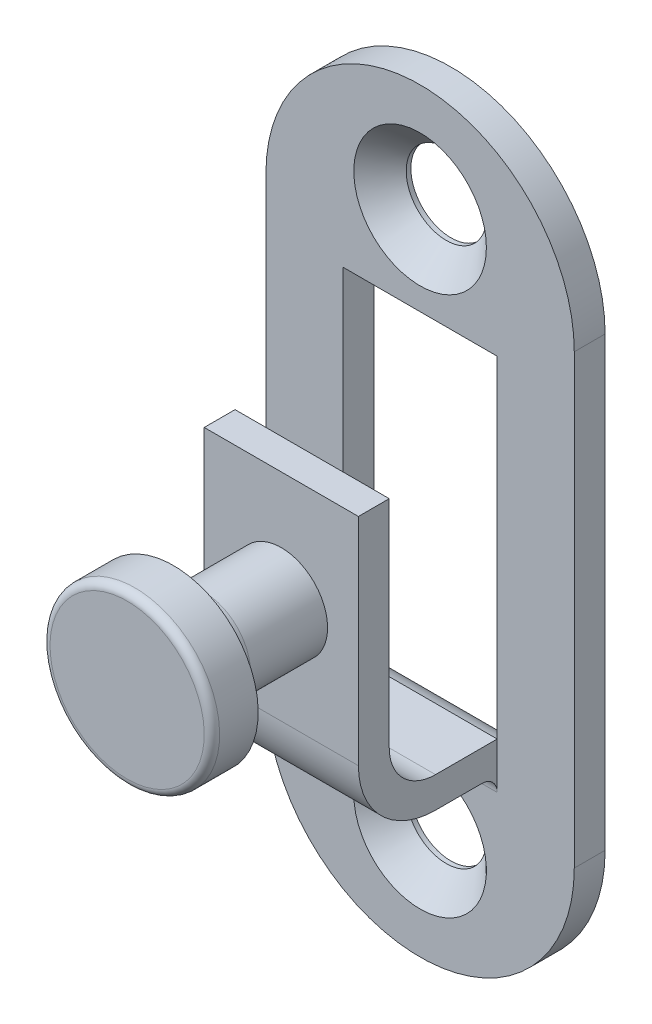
ISO-10303-21;
HEADER;
FILE_DESCRIPTION(('STEP AP214'),'2;1');
FILE_NAME('part.step','',(''),(''),'','','');
FILE_SCHEMA(('AUTOMOTIVE_DESIGN { 1 0 10303 214 1 1 1 1 }'));
ENDSEC;
DATA;
#1=APPLICATION_CONTEXT('core data for automotive mechanical design processes');
#2=APPLICATION_PROTOCOL_DEFINITION('international standard','automotive_design',2000,#1);
#3=PRODUCT_CONTEXT('',#1,'mechanical');
#4=PRODUCT('Part','Part','',(#3));
#5=PRODUCT_RELATED_PRODUCT_CATEGORY('part','',(#4));
#6=PRODUCT_DEFINITION_FORMATION('','',#4);
#7=PRODUCT_DEFINITION_CONTEXT('part definition',#1,'design');
#8=PRODUCT_DEFINITION('design','',#6,#7);
#9=PRODUCT_DEFINITION_SHAPE('','',#8);
#10=(LENGTH_UNIT() NAMED_UNIT(*) SI_UNIT(.MILLI.,.METRE.));
#11=(NAMED_UNIT(*) PLANE_ANGLE_UNIT() SI_UNIT($,.RADIAN.));
#12=(NAMED_UNIT(*) SI_UNIT($,.STERADIAN.) SOLID_ANGLE_UNIT());
#13=UNCERTAINTY_MEASURE_WITH_UNIT(LENGTH_MEASURE(1.E-05),#10,'distance_accuracy_value','');
#14=(GEOMETRIC_REPRESENTATION_CONTEXT(3) GLOBAL_UNCERTAINTY_ASSIGNED_CONTEXT((#13)) GLOBAL_UNIT_ASSIGNED_CONTEXT((#10,
#11,#12)) REPRESENTATION_CONTEXT('',''));
#15=CARTESIAN_POINT('',(0.,0.,0.));
#16=DIRECTION('',(0.,0.,1.));
#17=DIRECTION('',(1.,0.,0.));
#18=AXIS2_PLACEMENT_3D('',#15,#16,#17);
#19=CARTESIAN_POINT('',(0.,0.,9.));
#20=DIRECTION('',(0.,0.,-1.));
#21=DIRECTION('',(0.,1.,0.));
#22=AXIS2_PLACEMENT_3D('',#19,#20,#21);
#23=CONICAL_SURFACE('',#22,3.,0.785398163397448);
#24=CARTESIAN_POINT('',(0.,0.,9.));
#25=DIRECTION('',(0.,0.,1.));
#26=DIRECTION('',(0.,-1.,0.));
#27=AXIS2_PLACEMENT_3D('',#24,#25,#26);
#28=CIRCLE('',#27,3.);
#29=CARTESIAN_POINT('',(0.,-3.,9.));
#30=VERTEX_POINT('',#29);
#31=EDGE_CURVE('E645',#30,#30,#28,.T.);
#32=ORIENTED_EDGE('',*,*,#31,.F.);
#33=EDGE_LOOP('',(#32));
#34=FACE_BOUND('',#33,.T.);
#35=CARTESIAN_POINT('',(0.,0.,9.30675));
#36=DIRECTION('',(0.,0.,1.));
#37=DIRECTION('',(0.,-1.,0.));
#38=AXIS2_PLACEMENT_3D('',#35,#36,#37);
#39=CIRCLE('',#38,2.69325);
#40=CARTESIAN_POINT('',(0.,-2.69325,9.30675));
#41=VERTEX_POINT('',#40);
#42=EDGE_CURVE('E38',#41,#41,#39,.T.);
#43=ORIENTED_EDGE('',*,*,#42,.T.);
#44=EDGE_LOOP('',(#43));
#45=FACE_BOUND('',#44,.T.);
#46=ADVANCED_FACE('F34',(#34,#45),#23,.F.);
#47=CARTESIAN_POINT('',(5.,7.25,11.));
#48=DIRECTION('',(0.,0.,-1.));
#49=DIRECTION('',(-1.,0.,0.));
#50=AXIS2_PLACEMENT_3D('',#47,#48,#49);
#51=PLANE('',#50);
#52=DIRECTION('',(-1.,0.,0.));
#53=VECTOR('',#52,1.);
#54=CARTESIAN_POINT('',(5.,7.25,11.));
#55=LINE('',#54,#53);
#56=CARTESIAN_POINT('',(5.,7.25,11.));
#57=VERTEX_POINT('',#56);
#58=CARTESIAN_POINT('',(-5.,7.25,11.));
#59=VERTEX_POINT('',#58);
#60=EDGE_CURVE('E151',#57,#59,#55,.T.);
#61=ORIENTED_EDGE('',*,*,#60,.T.);
#62=DIRECTION('',(0.,-1.,0.));
#63=VECTOR('',#62,1.);
#64=CARTESIAN_POINT('',(-5.,7.25,11.));
#65=LINE('',#64,#63);
#66=CARTESIAN_POINT('',(-5.,-6.75,11.));
#67=VERTEX_POINT('',#66);
#68=EDGE_CURVE('E156',#59,#67,#65,.T.);
#69=ORIENTED_EDGE('',*,*,#68,.T.);
#70=DIRECTION('',(-1.,0.,0.));
#71=VECTOR('',#70,1.);
#72=CARTESIAN_POINT('',(5.,-6.75,11.));
#73=LINE('',#72,#71);
#74=CARTESIAN_POINT('',(5.,-6.75,11.));
#75=VERTEX_POINT('',#74);
#76=EDGE_CURVE('E163',#75,#67,#73,.T.);
#77=ORIENTED_EDGE('',*,*,#76,.F.);
#78=DIRECTION('',(0.,-1.,0.));
#79=VECTOR('',#78,1.);
#80=CARTESIAN_POINT('',(5.,7.25,11.));
#81=LINE('',#80,#79);
#82=EDGE_CURVE('E157',#57,#75,#81,.T.);
#83=ORIENTED_EDGE('',*,*,#82,.F.);
#84=EDGE_LOOP('',(#61,#69,#77,#83));
#85=FACE_BOUND('',#84,.T.);
#86=CARTESIAN_POINT('',(0.,0.,11.));
#87=DIRECTION('',(0.,0.,1.));
#88=DIRECTION('',(0.,-1.,0.));
#89=AXIS2_PLACEMENT_3D('',#86,#87,#88);
#90=CIRCLE('',#89,3.);
#91=CARTESIAN_POINT('',(0.,-3.,11.));
#92=VERTEX_POINT('',#91);
#93=EDGE_CURVE('E623',#92,#92,#90,.T.);
#94=ORIENTED_EDGE('',*,*,#93,.F.);
#95=EDGE_LOOP('',(#94));
#96=FACE_BOUND('',#95,.T.);
#97=ADVANCED_FACE('F153',(#85,#96),#51,.F.);
#98=CARTESIAN_POINT('',(5.,-6.75,9.));
#99=DIRECTION('',(0.,0.,1.));
#100=DIRECTION('',(1.,0.,0.));
#101=AXIS2_PLACEMENT_3D('',#98,#99,#100);
#102=PLANE('',#101);
#103=DIRECTION('',(-1.,0.,0.));
#104=VECTOR('',#103,1.);
#105=CARTESIAN_POINT('',(5.,-6.75,9.));
#106=LINE('',#105,#104);
#107=CARTESIAN_POINT('',(5.,-6.75,9.));
#108=VERTEX_POINT('',#107);
#109=CARTESIAN_POINT('',(-5.,-6.75,9.));
#110=VERTEX_POINT('',#109);
#111=EDGE_CURVE('E223',#108,#110,#106,.T.);
#112=ORIENTED_EDGE('',*,*,#111,.T.);
#113=DIRECTION('',(0.,1.,0.));
#114=VECTOR('',#113,1.);
#115=CARTESIAN_POINT('',(-5.,-6.75,9.));
#116=LINE('',#115,#114);
#117=CARTESIAN_POINT('',(-5.,7.25,9.));
#118=VERTEX_POINT('',#117);
#119=EDGE_CURVE('E202',#110,#118,#116,.T.);
#120=ORIENTED_EDGE('',*,*,#119,.T.);
#121=DIRECTION('',(-1.,0.,0.));
#122=VECTOR('',#121,1.);
#123=CARTESIAN_POINT('',(5.,7.25,9.));
#124=LINE('',#123,#122);
#125=CARTESIAN_POINT('',(5.,7.25,9.));
#126=VERTEX_POINT('',#125);
#127=EDGE_CURVE('E178',#126,#118,#124,.T.);
#128=ORIENTED_EDGE('',*,*,#127,.F.);
#129=DIRECTION('',(0.,1.,0.));
#130=VECTOR('',#129,1.);
#131=CARTESIAN_POINT('',(5.,-6.75,9.));
#132=LINE('',#131,#130);
#133=EDGE_CURVE('E220',#108,#126,#132,.T.);
#134=ORIENTED_EDGE('',*,*,#133,.F.);
#135=EDGE_LOOP('',(#112,#120,#128,#134));
#136=FACE_BOUND('',#135,.T.);
#137=ORIENTED_EDGE('',*,*,#31,.T.);
#138=EDGE_LOOP('',(#137));
#139=FACE_BOUND('',#138,.T.);
#140=ADVANCED_FACE('F322',(#136,#139),#102,.F.);
#141=CARTESIAN_POINT('',(0.,-14.5,2.));
#142=DIRECTION('',(0.,0.,1.));
#143=DIRECTION('',(1.,0.,0.));
#144=AXIS2_PLACEMENT_3D('',#141,#142,#143);
#145=PLANE('',#144);
#146=CARTESIAN_POINT('',(0.,17.5,2.));
#147=DIRECTION('',(0.,0.,1.));
#148=DIRECTION('',(1.,0.,0.));
#149=AXIS2_PLACEMENT_3D('',#146,#147,#148);
#150=CIRCLE('',#149,4.3);
#151=CARTESIAN_POINT('',(4.3,17.5,2.));
#152=VERTEX_POINT('',#151);
#153=EDGE_CURVE('E179',#152,#152,#150,.T.);
#154=ORIENTED_EDGE('',*,*,#153,.F.);
#155=EDGE_LOOP('',(#154));
#156=FACE_BOUND('',#155,.T.);
#157=DIRECTION('',(0.,1.,0.));
#158=VECTOR('',#157,1.);
#159=CARTESIAN_POINT('',(5.,-11.75,2.));
#160=LINE('',#159,#158);
#161=CARTESIAN_POINT('',(5.,-12.75,2.));
#162=VERTEX_POINT('',#161);
#163=CARTESIAN_POINT('',(5.,-9.75,2.));
#164=VERTEX_POINT('',#163);
#165=EDGE_CURVE('E245',#162,#164,#160,.T.);
#166=ORIENTED_EDGE('',*,*,#165,.F.);
#167=DIRECTION('',(-1.,0.,0.));
#168=VECTOR('',#167,1.);
#169=CARTESIAN_POINT('',(5.,-12.75,2.));
#170=LINE('',#169,#168);
#171=CARTESIAN_POINT('',(-5.,-12.75,2.));
#172=VERTEX_POINT('',#171);
#173=EDGE_CURVE('E229',#162,#172,#170,.T.);
#174=ORIENTED_EDGE('',*,*,#173,.T.);
#175=DIRECTION('',(0.,1.,0.));
#176=VECTOR('',#175,1.);
#177=CARTESIAN_POINT('',(-5.,-14.5,2.));
#178=LINE('',#177,#176);
#179=CARTESIAN_POINT('',(-5.,-9.75,2.));
#180=VERTEX_POINT('',#179);
#181=EDGE_CURVE('E162',#172,#180,#178,.T.);
#182=ORIENTED_EDGE('',*,*,#181,.T.);
#183=DIRECTION('',(0.,-1.,0.));
#184=VECTOR('',#183,1.);
#185=CARTESIAN_POINT('',(-5.,11.75,2.));
#186=LINE('',#185,#184);
#187=CARTESIAN_POINT('',(-5.,11.75,2.));
#188=VERTEX_POINT('',#187);
#189=EDGE_CURVE('E240',#188,#180,#186,.T.);
#190=ORIENTED_EDGE('',*,*,#189,.F.);
#191=DIRECTION('',(-1.,0.,0.));
#192=VECTOR('',#191,1.);
#193=CARTESIAN_POINT('',(5.,11.75,2.));
#194=LINE('',#193,#192);
#195=CARTESIAN_POINT('',(5.,11.75,2.));
#196=VERTEX_POINT('',#195);
#197=EDGE_CURVE('E238',#196,#188,#194,.T.);
#198=ORIENTED_EDGE('',*,*,#197,.F.);
#199=EDGE_CURVE('E244',#164,#196,#160,.T.);
#200=ORIENTED_EDGE('',*,*,#199,.F.);
#201=EDGE_LOOP('',(#166,#174,#182,#190,#198,#200));
#202=FACE_BOUND('',#201,.T.);
#203=CARTESIAN_POINT('',(0.,-14.5,2.));
#204=DIRECTION('',(0.,0.,1.));
#205=DIRECTION('',(1.,0.,0.));
#206=AXIS2_PLACEMENT_3D('',#203,#204,#205);
#207=CIRCLE('',#206,10.);
#208=CARTESIAN_POINT('',(-10.,-14.5,2.));
#209=VERTEX_POINT('',#208);
#210=CARTESIAN_POINT('',(10.,-14.5,2.));
#211=VERTEX_POINT('',#210);
#212=EDGE_CURVE('E262',#209,#211,#207,.T.);
#213=ORIENTED_EDGE('',*,*,#212,.T.);
#214=DIRECTION('',(0.,1.,0.));
#215=VECTOR('',#214,1.);
#216=CARTESIAN_POINT('',(10.,-14.5,2.));
#217=LINE('',#216,#215);
#218=CARTESIAN_POINT('',(10.,14.5,2.));
#219=VERTEX_POINT('',#218);
#220=EDGE_CURVE('E265',#211,#219,#217,.T.);
#221=ORIENTED_EDGE('',*,*,#220,.T.);
#222=CARTESIAN_POINT('',(0.,14.5,2.));
#223=DIRECTION('',(0.,0.,1.));
#224=DIRECTION('',(1.,0.,0.));
#225=AXIS2_PLACEMENT_3D('',#222,#223,#224);
#226=CIRCLE('',#225,10.);
#227=CARTESIAN_POINT('',(-10.,14.5,2.));
#228=VERTEX_POINT('',#227);
#229=EDGE_CURVE('E268',#219,#228,#226,.T.);
#230=ORIENTED_EDGE('',*,*,#229,.T.);
#231=DIRECTION('',(0.,-1.,0.));
#232=VECTOR('',#231,1.);
#233=CARTESIAN_POINT('',(-10.,14.5,2.));
#234=LINE('',#233,#232);
#235=EDGE_CURVE('E270',#228,#209,#234,.T.);
#236=ORIENTED_EDGE('',*,*,#235,.T.);
#237=EDGE_LOOP('',(#213,#221,#230,#236));
#238=FACE_BOUND('',#237,.T.);
#239=CARTESIAN_POINT('',(0.,-17.5,2.));
#240=DIRECTION('',(0.,0.,-1.));
#241=DIRECTION('',(-1.,0.,0.));
#242=AXIS2_PLACEMENT_3D('',#239,#240,#241);
#243=CIRCLE('',#242,4.3);
#244=CARTESIAN_POINT('',(-4.3,-17.5,2.));
#245=VERTEX_POINT('',#244);
#246=EDGE_CURVE('E649',#245,#245,#243,.T.);
#247=ORIENTED_EDGE('',*,*,#246,.T.);
#248=EDGE_LOOP('',(#247));
#249=FACE_BOUND('',#248,.T.);
#250=ADVANCED_FACE('F306',(#156,#202,#238,#249),#145,.T.);
#251=CARTESIAN_POINT('',(0.,-14.5,0.));
#252=DIRECTION('',(0.,0.,1.));
#253=DIRECTION('',(1.,0.,0.));
#254=AXIS2_PLACEMENT_3D('',#251,#252,#253);
#255=PLANE('',#254);
#256=CARTESIAN_POINT('',(0.,17.5,0.));
#257=DIRECTION('',(0.,0.,1.));
#258=DIRECTION('',(1.,0.,0.));
#259=AXIS2_PLACEMENT_3D('',#256,#257,#258);
#260=CIRCLE('',#259,2.6);
#261=CARTESIAN_POINT('',(2.6,17.5,0.));
#262=VERTEX_POINT('',#261);
#263=EDGE_CURVE('E658',#262,#262,#260,.T.);
#264=ORIENTED_EDGE('',*,*,#263,.T.);
#265=EDGE_LOOP('',(#264));
#266=FACE_BOUND('',#265,.T.);
#267=DIRECTION('',(1.,0.,0.));
#268=VECTOR('',#267,1.);
#269=CARTESIAN_POINT('',(-5.,-11.75,0.));
#270=LINE('',#269,#268);
#271=CARTESIAN_POINT('',(-5.,-11.75,0.));
#272=VERTEX_POINT('',#271);
#273=CARTESIAN_POINT('',(5.,-11.75,0.));
#274=VERTEX_POINT('',#273);
#275=EDGE_CURVE('E253',#272,#274,#270,.T.);
#276=ORIENTED_EDGE('',*,*,#275,.T.);
#277=DIRECTION('',(0.,1.,0.));
#278=VECTOR('',#277,1.);
#279=CARTESIAN_POINT('',(5.,-11.75,0.));
#280=LINE('',#279,#278);
#281=CARTESIAN_POINT('',(5.,11.75,0.));
#282=VERTEX_POINT('',#281);
#283=EDGE_CURVE('E241',#274,#282,#280,.T.);
#284=ORIENTED_EDGE('',*,*,#283,.T.);
#285=DIRECTION('',(-1.,0.,0.));
#286=VECTOR('',#285,1.);
#287=CARTESIAN_POINT('',(5.,11.75,0.));
#288=LINE('',#287,#286);
#289=CARTESIAN_POINT('',(-5.,11.75,0.));
#290=VERTEX_POINT('',#289);
#291=EDGE_CURVE('E58',#282,#290,#288,.T.);
#292=ORIENTED_EDGE('',*,*,#291,.T.);
#293=DIRECTION('',(0.,-1.,0.));
#294=VECTOR('',#293,1.);
#295=CARTESIAN_POINT('',(-5.,11.75,0.));
#296=LINE('',#295,#294);
#297=EDGE_CURVE('E250',#290,#272,#296,.T.);
#298=ORIENTED_EDGE('',*,*,#297,.T.);
#299=EDGE_LOOP('',(#276,#284,#292,#298));
#300=FACE_BOUND('',#299,.T.);
#301=CARTESIAN_POINT('',(0.,-14.5,0.));
#302=DIRECTION('',(0.,0.,1.));
#303=DIRECTION('',(1.,0.,0.));
#304=AXIS2_PLACEMENT_3D('',#301,#302,#303);
#305=CIRCLE('',#304,10.);
#306=CARTESIAN_POINT('',(-10.,-14.5,0.));
#307=VERTEX_POINT('',#306);
#308=CARTESIAN_POINT('',(10.,-14.5,0.));
#309=VERTEX_POINT('',#308);
#310=EDGE_CURVE('E261',#307,#309,#305,.T.);
#311=ORIENTED_EDGE('',*,*,#310,.F.);
#312=DIRECTION('',(0.,-1.,0.));
#313=VECTOR('',#312,1.);
#314=CARTESIAN_POINT('',(-10.,14.5,0.));
#315=LINE('',#314,#313);
#316=CARTESIAN_POINT('',(-10.,14.5,0.));
#317=VERTEX_POINT('',#316);
#318=EDGE_CURVE('E266',#317,#307,#315,.T.);
#319=ORIENTED_EDGE('',*,*,#318,.F.);
#320=CARTESIAN_POINT('',(0.,14.5,0.));
#321=DIRECTION('',(0.,0.,1.));
#322=DIRECTION('',(1.,0.,0.));
#323=AXIS2_PLACEMENT_3D('',#320,#321,#322);
#324=CIRCLE('',#323,10.);
#325=CARTESIAN_POINT('',(10.,14.5,0.));
#326=VERTEX_POINT('',#325);
#327=EDGE_CURVE('E277',#326,#317,#324,.T.);
#328=ORIENTED_EDGE('',*,*,#327,.F.);
#329=DIRECTION('',(0.,1.,0.));
#330=VECTOR('',#329,1.);
#331=CARTESIAN_POINT('',(10.,-14.5,0.));
#332=LINE('',#331,#330);
#333=EDGE_CURVE('E275',#309,#326,#332,.T.);
#334=ORIENTED_EDGE('',*,*,#333,.F.);
#335=EDGE_LOOP('',(#311,#319,#328,#334));
#336=FACE_BOUND('',#335,.T.);
#337=CARTESIAN_POINT('',(0.,-17.5,0.));
#338=DIRECTION('',(0.,0.,-1.));
#339=DIRECTION('',(-1.,0.,0.));
#340=AXIS2_PLACEMENT_3D('',#337,#338,#339);
#341=CIRCLE('',#340,2.6);
#342=CARTESIAN_POINT('',(-2.6,-17.5,0.));
#343=VERTEX_POINT('',#342);
#344=EDGE_CURVE('E655',#343,#343,#341,.T.);
#345=ORIENTED_EDGE('',*,*,#344,.F.);
#346=EDGE_LOOP('',(#345));
#347=FACE_BOUND('',#346,.T.);
#348=ADVANCED_FACE('F296',(#266,#300,#336,#347),#255,.F.);
#349=CARTESIAN_POINT('',(-5.,11.75,2.));
#350=DIRECTION('',(1.,0.,0.));
#351=DIRECTION('',(0.,0.,-1.));
#352=AXIS2_PLACEMENT_3D('',#349,#350,#351);
#353=PLANE('',#352);
#354=ORIENTED_EDGE('',*,*,#189,.T.);
#355=CARTESIAN_POINT('',(-5.,-12.6208286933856,2.8708286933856));
#356=DIRECTION('',(1.,0.,0.));
#357=DIRECTION('',(0.,0.,-1.));
#358=AXIS2_PLACEMENT_3D('',#355,#356,#357);
#359=CIRCLE('',#358,2.99999999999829);
#360=EDGE_CURVE('E193',#272,#180,#359,.T.);
#361=ORIENTED_EDGE('',*,*,#360,.F.);
#362=ORIENTED_EDGE('',*,*,#297,.F.);
#363=DIRECTION('',(0.,0.,-1.));
#364=VECTOR('',#363,1.);
#365=CARTESIAN_POINT('',(-5.,11.75,2.));
#366=LINE('',#365,#364);
#367=EDGE_CURVE('E259',#188,#290,#366,.T.);
#368=ORIENTED_EDGE('',*,*,#367,.F.);
#369=EDGE_LOOP('',(#354,#361,#362,#368));
#370=FACE_BOUND('',#369,.T.);
#371=ADVANCED_FACE('F384',(#370),#353,.T.);
#372=CARTESIAN_POINT('',(5.,-11.75,2.));
#373=DIRECTION('',(-1.,0.,0.));
#374=DIRECTION('',(0.,0.,1.));
#375=AXIS2_PLACEMENT_3D('',#372,#373,#374);
#376=PLANE('',#375);
#377=ORIENTED_EDGE('',*,*,#283,.F.);
#378=CARTESIAN_POINT('',(5.,-12.6208286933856,2.8708286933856));
#379=DIRECTION('',(1.,0.,0.));
#380=DIRECTION('',(0.,0.,-1.));
#381=AXIS2_PLACEMENT_3D('',#378,#379,#380);
#382=CIRCLE('',#381,2.99999999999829);
#383=EDGE_CURVE('E214',#274,#164,#382,.T.);
#384=ORIENTED_EDGE('',*,*,#383,.T.);
#385=ORIENTED_EDGE('',*,*,#199,.T.);
#386=DIRECTION('',(0.,0.,-1.));
#387=VECTOR('',#386,1.);
#388=CARTESIAN_POINT('',(5.,11.75,2.));
#389=LINE('',#388,#387);
#390=EDGE_CURVE('E248',#196,#282,#389,.T.);
#391=ORIENTED_EDGE('',*,*,#390,.T.);
#392=EDGE_LOOP('',(#377,#384,#385,#391));
#393=FACE_BOUND('',#392,.T.);
#394=ADVANCED_FACE('F315',(#393),#376,.T.);
#395=CARTESIAN_POINT('',(0.,-14.5,2.));
#396=DIRECTION('',(0.,0.,-1.));
#397=DIRECTION('',(-1.,0.,0.));
#398=AXIS2_PLACEMENT_3D('',#395,#396,#397);
#399=CYLINDRICAL_SURFACE('',#398,10.);
#400=ORIENTED_EDGE('',*,*,#310,.T.);
#401=DIRECTION('',(0.,0.,-1.));
#402=VECTOR('',#401,1.);
#403=CARTESIAN_POINT('',(10.,-14.5,2.));
#404=LINE('',#403,#402);
#405=EDGE_CURVE('E11',#211,#309,#404,.T.);
#406=ORIENTED_EDGE('',*,*,#405,.F.);
#407=ORIENTED_EDGE('',*,*,#212,.F.);
#408=DIRECTION('',(0.,0.,-1.));
#409=VECTOR('',#408,1.);
#410=CARTESIAN_POINT('',(-10.,-14.5,2.));
#411=LINE('',#410,#409);
#412=EDGE_CURVE('E272',#209,#307,#411,.T.);
#413=ORIENTED_EDGE('',*,*,#412,.T.);
#414=EDGE_LOOP('',(#400,#406,#407,#413));
#415=FACE_BOUND('',#414,.T.);
#416=ADVANCED_FACE('F36',(#415),#399,.T.);
#417=CARTESIAN_POINT('',(10.,-14.5,2.));
#418=DIRECTION('',(-1.,0.,0.));
#419=DIRECTION('',(0.,0.,1.));
#420=AXIS2_PLACEMENT_3D('',#417,#418,#419);
#421=PLANE('',#420);
#422=ORIENTED_EDGE('',*,*,#333,.T.);
#423=DIRECTION('',(0.,0.,-1.));
#424=VECTOR('',#423,1.);
#425=CARTESIAN_POINT('',(10.,14.5,2.));
#426=LINE('',#425,#424);
#427=EDGE_CURVE('E43',#219,#326,#426,.T.);
#428=ORIENTED_EDGE('',*,*,#427,.F.);
#429=ORIENTED_EDGE('',*,*,#220,.F.);
#430=ORIENTED_EDGE('',*,*,#405,.T.);
#431=EDGE_LOOP('',(#422,#428,#429,#430));
#432=FACE_BOUND('',#431,.T.);
#433=ADVANCED_FACE('F308',(#432),#421,.F.);
#434=CARTESIAN_POINT('',(0.,14.5,2.));
#435=DIRECTION('',(0.,0.,-1.));
#436=DIRECTION('',(-1.,0.,0.));
#437=AXIS2_PLACEMENT_3D('',#434,#435,#436);
#438=CYLINDRICAL_SURFACE('',#437,10.);
#439=ORIENTED_EDGE('',*,*,#327,.T.);
#440=DIRECTION('',(0.,0.,-1.));
#441=VECTOR('',#440,1.);
#442=CARTESIAN_POINT('',(-10.,14.5,2.));
#443=LINE('',#442,#441);
#444=EDGE_CURVE('E282',#228,#317,#443,.T.);
#445=ORIENTED_EDGE('',*,*,#444,.F.);
#446=ORIENTED_EDGE('',*,*,#229,.F.);
#447=ORIENTED_EDGE('',*,*,#427,.T.);
#448=EDGE_LOOP('',(#439,#445,#446,#447));
#449=FACE_BOUND('',#448,.T.);
#450=ADVANCED_FACE('F290',(#449),#438,.T.);
#451=CARTESIAN_POINT('',(-10.,14.5,2.));
#452=DIRECTION('',(1.,0.,0.));
#453=DIRECTION('',(0.,0.,-1.));
#454=AXIS2_PLACEMENT_3D('',#451,#452,#453);
#455=PLANE('',#454);
#456=ORIENTED_EDGE('',*,*,#318,.T.);
#457=ORIENTED_EDGE('',*,*,#412,.F.);
#458=ORIENTED_EDGE('',*,*,#235,.F.);
#459=ORIENTED_EDGE('',*,*,#444,.T.);
#460=EDGE_LOOP('',(#456,#457,#458,#459));
#461=FACE_BOUND('',#460,.T.);
#462=ADVANCED_FACE('F300',(#461),#455,.F.);
#463=CARTESIAN_POINT('',(5.,11.75,2.));
#464=DIRECTION('',(0.,-1.,0.));
#465=DIRECTION('',(0.,0.,-1.));
#466=AXIS2_PLACEMENT_3D('',#463,#464,#465);
#467=PLANE('',#466);
#468=ORIENTED_EDGE('',*,*,#291,.F.);
#469=ORIENTED_EDGE('',*,*,#390,.F.);
#470=ORIENTED_EDGE('',*,*,#197,.T.);
#471=ORIENTED_EDGE('',*,*,#367,.T.);
#472=EDGE_LOOP('',(#468,#469,#470,#471));
#473=FACE_BOUND('',#472,.T.);
#474=ADVANCED_FACE('F381',(#473),#467,.T.);
#475=CARTESIAN_POINT('',(5.,7.25,9.));
#476=DIRECTION('',(0.,-1.,0.));
#477=DIRECTION('',(0.,0.,-1.));
#478=AXIS2_PLACEMENT_3D('',#475,#476,#477);
#479=PLANE('',#478);
#480=ORIENTED_EDGE('',*,*,#127,.T.);
#481=DIRECTION('',(0.,0.,1.));
#482=VECTOR('',#481,1.);
#483=CARTESIAN_POINT('',(-5.,7.25,9.));
#484=LINE('',#483,#482);
#485=EDGE_CURVE('E170',#118,#59,#484,.T.);
#486=ORIENTED_EDGE('',*,*,#485,.T.);
#487=ORIENTED_EDGE('',*,*,#60,.F.);
#488=DIRECTION('',(0.,0.,1.));
#489=VECTOR('',#488,1.);
#490=CARTESIAN_POINT('',(5.,7.25,9.));
#491=LINE('',#490,#489);
#492=EDGE_CURVE('E204',#126,#57,#491,.T.);
#493=ORIENTED_EDGE('',*,*,#492,.F.);
#494=EDGE_LOOP('',(#480,#486,#487,#493));
#495=FACE_BOUND('',#494,.T.);
#496=ADVANCED_FACE('F176',(#495),#479,.F.);
#497=CARTESIAN_POINT('',(5.,-6.75000000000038,6.00000000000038));
#498=DIRECTION('',(-1.,0.,0.));
#499=DIRECTION('',(0.,0.,1.));
#500=AXIS2_PLACEMENT_3D('',#497,#498,#499);
#501=CYLINDRICAL_SURFACE('',#500,4.99999999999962);
#502=ORIENTED_EDGE('',*,*,#76,.T.);
#503=CARTESIAN_POINT('',(-5.,-6.75000000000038,6.00000000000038));
#504=DIRECTION('',(1.,0.,0.));
#505=DIRECTION('',(0.,0.,-1.));
#506=AXIS2_PLACEMENT_3D('',#503,#504,#505);
#507=CIRCLE('',#506,4.99999999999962);
#508=CARTESIAN_POINT('',(-5.,-11.75,6.));
#509=VERTEX_POINT('',#508);
#510=EDGE_CURVE('E174',#67,#509,#507,.T.);
#511=ORIENTED_EDGE('',*,*,#510,.T.);
#512=DIRECTION('',(-1.,0.,0.));
#513=VECTOR('',#512,1.);
#514=CARTESIAN_POINT('',(5.,-11.75,6.));
#515=LINE('',#514,#513);
#516=CARTESIAN_POINT('',(5.,-11.75,6.));
#517=VERTEX_POINT('',#516);
#518=EDGE_CURVE('E234',#517,#509,#515,.T.);
#519=ORIENTED_EDGE('',*,*,#518,.F.);
#520=CARTESIAN_POINT('',(5.,-6.75000000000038,6.00000000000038));
#521=DIRECTION('',(1.,0.,0.));
#522=DIRECTION('',(0.,0.,-1.));
#523=AXIS2_PLACEMENT_3D('',#520,#521,#522);
#524=CIRCLE('',#523,4.99999999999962);
#525=EDGE_CURVE('E207',#75,#517,#524,.T.);
#526=ORIENTED_EDGE('',*,*,#525,.F.);
#527=EDGE_LOOP('',(#502,#511,#519,#526));
#528=FACE_BOUND('',#527,.T.);
#529=ADVANCED_FACE('F374',(#528),#501,.T.);
#530=CARTESIAN_POINT('',(5.,-11.75,6.));
#531=DIRECTION('',(0.,1.,0.));
#532=DIRECTION('',(0.,0.,1.));
#533=AXIS2_PLACEMENT_3D('',#530,#531,#532);
#534=PLANE('',#533);
#535=ORIENTED_EDGE('',*,*,#518,.T.);
#536=DIRECTION('',(0.,0.,-1.));
#537=VECTOR('',#536,1.);
#538=CARTESIAN_POINT('',(-5.,-11.75,6.));
#539=LINE('',#538,#537);
#540=CARTESIAN_POINT('',(-5.,-11.75,3.));
#541=VERTEX_POINT('',#540);
#542=EDGE_CURVE('E187',#509,#541,#539,.T.);
#543=ORIENTED_EDGE('',*,*,#542,.T.);
#544=DIRECTION('',(-1.,0.,0.));
#545=VECTOR('',#544,1.);
#546=CARTESIAN_POINT('',(5.,-11.75,3.));
#547=LINE('',#546,#545);
#548=CARTESIAN_POINT('',(5.,-11.75,3.));
#549=VERTEX_POINT('',#548);
#550=EDGE_CURVE('E232',#549,#541,#547,.T.);
#551=ORIENTED_EDGE('',*,*,#550,.F.);
#552=DIRECTION('',(0.,0.,-1.));
#553=VECTOR('',#552,1.);
#554=CARTESIAN_POINT('',(5.,-11.75,6.));
#555=LINE('',#554,#553);
#556=EDGE_CURVE('E209',#517,#549,#555,.T.);
#557=ORIENTED_EDGE('',*,*,#556,.F.);
#558=EDGE_LOOP('',(#535,#543,#551,#557));
#559=FACE_BOUND('',#558,.T.);
#560=ADVANCED_FACE('F370',(#559),#534,.F.);
#561=CARTESIAN_POINT('',(5.,-12.7499999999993,2.99999999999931));
#562=DIRECTION('',(-1.,0.,0.));
#563=DIRECTION('',(0.,0.,1.));
#564=AXIS2_PLACEMENT_3D('',#561,#562,#563);
#565=CYLINDRICAL_SURFACE('',#564,0.999999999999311);
#566=ORIENTED_EDGE('',*,*,#550,.T.);
#567=CARTESIAN_POINT('',(-5.,-12.7499999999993,2.99999999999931));
#568=DIRECTION('',(-1.,0.,0.));
#569=DIRECTION('',(0.,0.,1.));
#570=AXIS2_PLACEMENT_3D('',#567,#568,#569);
#571=CIRCLE('',#570,0.999999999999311);
#572=EDGE_CURVE('E190',#541,#172,#571,.T.);
#573=ORIENTED_EDGE('',*,*,#572,.T.);
#574=ORIENTED_EDGE('',*,*,#173,.F.);
#575=CARTESIAN_POINT('',(5.,-12.7499999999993,2.99999999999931));
#576=DIRECTION('',(-1.,0.,0.));
#577=DIRECTION('',(0.,0.,1.));
#578=AXIS2_PLACEMENT_3D('',#575,#576,#577);
#579=CIRCLE('',#578,0.999999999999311);
#580=EDGE_CURVE('E211',#549,#162,#579,.T.);
#581=ORIENTED_EDGE('',*,*,#580,.F.);
#582=EDGE_LOOP('',(#566,#573,#574,#581));
#583=FACE_BOUND('',#582,.T.);
#584=ADVANCED_FACE('F366',(#583),#565,.F.);
#585=CARTESIAN_POINT('',(5.,-12.6208286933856,2.8708286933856));
#586=DIRECTION('',(-1.,0.,0.));
#587=DIRECTION('',(0.,0.,1.));
#588=AXIS2_PLACEMENT_3D('',#585,#586,#587);
#589=CYLINDRICAL_SURFACE('',#588,2.99999999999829);
#590=ORIENTED_EDGE('',*,*,#275,.F.);
#591=ORIENTED_EDGE('',*,*,#360,.T.);
#592=DIRECTION('',(-1.,0.,0.));
#593=VECTOR('',#592,1.);
#594=CARTESIAN_POINT('',(5.,-9.75,2.));
#595=LINE('',#594,#593);
#596=EDGE_CURVE('E227',#164,#180,#595,.T.);
#597=ORIENTED_EDGE('',*,*,#596,.F.);
#598=ORIENTED_EDGE('',*,*,#383,.F.);
#599=EDGE_LOOP('',(#590,#591,#597,#598));
#600=FACE_BOUND('',#599,.T.);
#601=ADVANCED_FACE('F363',(#600),#589,.T.);
#602=CARTESIAN_POINT('',(5.,-9.75,2.));
#603=DIRECTION('',(0.,-1.,0.));
#604=DIRECTION('',(0.,0.,-1.));
#605=AXIS2_PLACEMENT_3D('',#602,#603,#604);
#606=PLANE('',#605);
#607=ORIENTED_EDGE('',*,*,#596,.T.);
#608=DIRECTION('',(0.,0.,1.));
#609=VECTOR('',#608,1.);
#610=CARTESIAN_POINT('',(-5.,-9.75,2.));
#611=LINE('',#610,#609);
#612=CARTESIAN_POINT('',(-5.,-9.75,6.));
#613=VERTEX_POINT('',#612);
#614=EDGE_CURVE('E196',#180,#613,#611,.T.);
#615=ORIENTED_EDGE('',*,*,#614,.T.);
#616=DIRECTION('',(-1.,0.,0.));
#617=VECTOR('',#616,1.);
#618=CARTESIAN_POINT('',(5.,-9.75,6.));
#619=LINE('',#618,#617);
#620=CARTESIAN_POINT('',(5.,-9.75,6.));
#621=VERTEX_POINT('',#620);
#622=EDGE_CURVE('E225',#621,#613,#619,.T.);
#623=ORIENTED_EDGE('',*,*,#622,.F.);
#624=DIRECTION('',(0.,0.,1.));
#625=VECTOR('',#624,1.);
#626=CARTESIAN_POINT('',(5.,-9.75,2.));
#627=LINE('',#626,#625);
#628=EDGE_CURVE('E50',#164,#621,#627,.T.);
#629=ORIENTED_EDGE('',*,*,#628,.F.);
#630=EDGE_LOOP('',(#607,#615,#623,#629));
#631=FACE_BOUND('',#630,.T.);
#632=ADVANCED_FACE('F359',(#631),#606,.F.);
#633=CARTESIAN_POINT('',(5.,-6.75000000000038,6.00000000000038));
#634=DIRECTION('',(-1.,0.,0.));
#635=DIRECTION('',(0.,0.,1.));
#636=AXIS2_PLACEMENT_3D('',#633,#634,#635);
#637=CYLINDRICAL_SURFACE('',#636,2.99999999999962);
#638=ORIENTED_EDGE('',*,*,#622,.T.);
#639=CARTESIAN_POINT('',(-5.,-6.75000000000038,6.00000000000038));
#640=DIRECTION('',(-1.,0.,0.));
#641=DIRECTION('',(0.,0.,1.));
#642=AXIS2_PLACEMENT_3D('',#639,#640,#641);
#643=CIRCLE('',#642,2.99999999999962);
#644=EDGE_CURVE('E199',#613,#110,#643,.T.);
#645=ORIENTED_EDGE('',*,*,#644,.T.);
#646=ORIENTED_EDGE('',*,*,#111,.F.);
#647=CARTESIAN_POINT('',(5.,-6.75000000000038,6.00000000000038));
#648=DIRECTION('',(-1.,0.,0.));
#649=DIRECTION('',(0.,0.,1.));
#650=AXIS2_PLACEMENT_3D('',#647,#648,#649);
#651=CIRCLE('',#650,2.99999999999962);
#652=EDGE_CURVE('E218',#621,#108,#651,.T.);
#653=ORIENTED_EDGE('',*,*,#652,.F.);
#654=EDGE_LOOP('',(#638,#645,#646,#653));
#655=FACE_BOUND('',#654,.T.);
#656=ADVANCED_FACE('F352',(#655),#637,.F.);
#657=CARTESIAN_POINT('',(5.,-6.75000000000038,6.00000000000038));
#658=DIRECTION('',(1.,0.,0.));
#659=DIRECTION('',(0.,0.,-1.));
#660=AXIS2_PLACEMENT_3D('',#657,#658,#659);
#661=PLANE('',#660);
#662=ORIENTED_EDGE('',*,*,#580,.T.);
#663=ORIENTED_EDGE('',*,*,#165,.T.);
#664=ORIENTED_EDGE('',*,*,#628,.T.);
#665=ORIENTED_EDGE('',*,*,#652,.T.);
#666=ORIENTED_EDGE('',*,*,#133,.T.);
#667=ORIENTED_EDGE('',*,*,#492,.T.);
#668=ORIENTED_EDGE('',*,*,#82,.T.);
#669=ORIENTED_EDGE('',*,*,#525,.T.);
#670=ORIENTED_EDGE('',*,*,#556,.T.);
#671=EDGE_LOOP('',(#662,#663,#664,#665,#666,#667,#668,#669,#670));
#672=FACE_BOUND('',#671,.T.);
#673=ADVANCED_FACE('F349',(#672),#661,.T.);
#674=CARTESIAN_POINT('',(-5.,-6.75000000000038,6.00000000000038));
#675=DIRECTION('',(1.,0.,0.));
#676=DIRECTION('',(0.,0.,-1.));
#677=AXIS2_PLACEMENT_3D('',#674,#675,#676);
#678=PLANE('',#677);
#679=ORIENTED_EDGE('',*,*,#181,.F.);
#680=ORIENTED_EDGE('',*,*,#572,.F.);
#681=ORIENTED_EDGE('',*,*,#542,.F.);
#682=ORIENTED_EDGE('',*,*,#510,.F.);
#683=ORIENTED_EDGE('',*,*,#68,.F.);
#684=ORIENTED_EDGE('',*,*,#485,.F.);
#685=ORIENTED_EDGE('',*,*,#119,.F.);
#686=ORIENTED_EDGE('',*,*,#644,.F.);
#687=ORIENTED_EDGE('',*,*,#614,.F.);
#688=EDGE_LOOP('',(#679,#680,#681,#682,#683,#684,#685,#686,#687));
#689=FACE_BOUND('',#688,.T.);
#690=ADVANCED_FACE('F168',(#689),#678,.F.);
#691=CARTESIAN_POINT('',(0.,17.5,0.299999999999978));
#692=DIRECTION('',(0.,0.,1.));
#693=DIRECTION('',(1.,0.,0.));
#694=AXIS2_PLACEMENT_3D('',#691,#692,#693);
#695=CONICAL_SURFACE('',#694,2.6,0.785398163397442);
#696=ORIENTED_EDGE('',*,*,#153,.T.);
#697=EDGE_LOOP('',(#696));
#698=FACE_BOUND('',#697,.T.);
#699=CARTESIAN_POINT('',(0.,17.5,0.299999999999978));
#700=DIRECTION('',(0.,0.,1.));
#701=DIRECTION('',(1.,0.,0.));
#702=AXIS2_PLACEMENT_3D('',#699,#700,#701);
#703=CIRCLE('',#702,2.6);
#704=CARTESIAN_POINT('',(2.6,17.5,0.299999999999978));
#705=VERTEX_POINT('',#704);
#706=EDGE_CURVE('E182',#705,#705,#703,.T.);
#707=ORIENTED_EDGE('',*,*,#706,.F.);
#708=EDGE_LOOP('',(#707));
#709=FACE_BOUND('',#708,.T.);
#710=ADVANCED_FACE('F342',(#698,#709),#695,.F.);
#711=CARTESIAN_POINT('',(0.,17.5,0.));
#712=DIRECTION('',(0.,0.,1.));
#713=DIRECTION('',(1.,0.,0.));
#714=AXIS2_PLACEMENT_3D('',#711,#712,#713);
#715=CYLINDRICAL_SURFACE('',#714,2.6);
#716=ORIENTED_EDGE('',*,*,#706,.T.);
#717=EDGE_LOOP('',(#716));
#718=FACE_BOUND('',#717,.T.);
#719=ORIENTED_EDGE('',*,*,#263,.F.);
#720=EDGE_LOOP('',(#719));
#721=FACE_BOUND('',#720,.T.);
#722=ADVANCED_FACE('F338',(#718,#721),#715,.F.);
#723=CARTESIAN_POINT('',(0.,-17.5,2.));
#724=DIRECTION('',(0.,0.,-1.));
#725=DIRECTION('',(-1.,0.,0.));
#726=AXIS2_PLACEMENT_3D('',#723,#724,#725);
#727=CYLINDRICAL_SURFACE('',#726,2.6);
#728=ORIENTED_EDGE('',*,*,#344,.T.);
#729=EDGE_LOOP('',(#728));
#730=FACE_BOUND('',#729,.T.);
#731=CARTESIAN_POINT('',(0.,-17.5,0.299999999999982));
#732=DIRECTION('',(0.,0.,-1.));
#733=DIRECTION('',(-1.,0.,0.));
#734=AXIS2_PLACEMENT_3D('',#731,#732,#733);
#735=CIRCLE('',#734,2.6);
#736=CARTESIAN_POINT('',(-2.6,-17.5,0.299999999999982));
#737=VERTEX_POINT('',#736);
#738=EDGE_CURVE('E652',#737,#737,#735,.T.);
#739=ORIENTED_EDGE('',*,*,#738,.F.);
#740=EDGE_LOOP('',(#739));
#741=FACE_BOUND('',#740,.T.);
#742=ADVANCED_FACE('F334',(#730,#741),#727,.F.);
#743=CARTESIAN_POINT('',(0.,-17.5,2.));
#744=DIRECTION('',(0.,0.,1.));
#745=DIRECTION('',(1.,0.,0.));
#746=AXIS2_PLACEMENT_3D('',#743,#744,#745);
#747=CONICAL_SURFACE('',#746,4.3,0.785398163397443);
#748=ORIENTED_EDGE('',*,*,#738,.T.);
#749=EDGE_LOOP('',(#748));
#750=FACE_BOUND('',#749,.T.);
#751=ORIENTED_EDGE('',*,*,#246,.F.);
#752=EDGE_LOOP('',(#751));
#753=FACE_BOUND('',#752,.T.);
#754=ADVANCED_FACE('F330',(#750,#753),#747,.F.);
#755=CARTESIAN_POINT('',(0.,2.3865,9.));
#756=DIRECTION('',(0.,0.,1.));
#757=DIRECTION('',(0.,-1.,0.));
#758=AXIS2_PLACEMENT_3D('',#755,#756,#757);
#759=PLANE('',#758);
#760=CARTESIAN_POINT('',(0.,0.,9.));
#761=DIRECTION('',(0.,0.,1.));
#762=DIRECTION('',(0.,-1.,0.));
#763=AXIS2_PLACEMENT_3D('',#760,#761,#762);
#764=CIRCLE('',#763,2.3865);
#765=CARTESIAN_POINT('',(0.,-2.3865,9.));
#766=VERTEX_POINT('',#765);
#767=EDGE_CURVE('E629',#766,#766,#764,.T.);
#768=ORIENTED_EDGE('',*,*,#767,.F.);
#769=EDGE_LOOP('',(#768));
#770=FACE_BOUND('',#769,.T.);
#771=ADVANCED_FACE('F333',(#770),#759,.F.);
#772=CARTESIAN_POINT('',(0.,0.,9.));
#773=DIRECTION('',(0.,0.,1.));
#774=DIRECTION('',(0.,-1.,0.));
#775=AXIS2_PLACEMENT_3D('',#772,#773,#774);
#776=CONICAL_SURFACE('',#775,2.3865,0.785398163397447);
#777=ORIENTED_EDGE('',*,*,#42,.F.);
#778=EDGE_LOOP('',(#777));
#779=FACE_BOUND('',#778,.T.);
#780=ORIENTED_EDGE('',*,*,#767,.T.);
#781=EDGE_LOOP('',(#780));
#782=FACE_BOUND('',#781,.T.);
#783=ADVANCED_FACE('F469',(#779,#782),#776,.T.);
#784=CARTESIAN_POINT('',(0.,0.,21.));
#785=DIRECTION('',(0.,0.,-1.));
#786=DIRECTION('',(0.,1.,0.));
#787=AXIS2_PLACEMENT_3D('',#784,#785,#786);
#788=PLANE('',#787);
#789=CARTESIAN_POINT('',(0.,0.,21.));
#790=DIRECTION('',(0.,0.,1.));
#791=DIRECTION('',(0.,-1.,0.));
#792=AXIS2_PLACEMENT_3D('',#789,#790,#791);
#793=CIRCLE('',#792,5.);
#794=CARTESIAN_POINT('',(0.,-5.,21.));
#795=VERTEX_POINT('',#794);
#796=EDGE_CURVE('E642',#795,#795,#793,.T.);
#797=ORIENTED_EDGE('',*,*,#796,.T.);
#798=EDGE_LOOP('',(#797));
#799=FACE_BOUND('',#798,.T.);
#800=ADVANCED_FACE('F328',(#799),#788,.F.);
#801=CARTESIAN_POINT('',(0.,0.,20.4999999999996));
#802=DIRECTION('',(0.,0.,1.));
#803=DIRECTION('',(0.,-1.,0.));
#804=AXIS2_PLACEMENT_3D('',#801,#802,#803);
#805=TOROIDAL_SURFACE('',#804,4.99999999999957,0.500000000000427);
#806=ORIENTED_EDGE('',*,*,#796,.F.);
#807=EDGE_LOOP('',(#806));
#808=FACE_BOUND('',#807,.T.);
#809=CARTESIAN_POINT('',(0.,0.,20.5));
#810=DIRECTION('',(0.,0.,1.));
#811=DIRECTION('',(0.,-1.,0.));
#812=AXIS2_PLACEMENT_3D('',#809,#810,#811);
#813=CIRCLE('',#812,5.5);
#814=CARTESIAN_POINT('',(0.,-5.5,20.5));
#815=VERTEX_POINT('',#814);
#816=EDGE_CURVE('E639',#815,#815,#813,.T.);
#817=ORIENTED_EDGE('',*,*,#816,.T.);
#818=EDGE_LOOP('',(#817));
#819=FACE_BOUND('',#818,.T.);
#820=ADVANCED_FACE('F484',(#808,#819),#805,.T.);
#821=CARTESIAN_POINT('',(0.,0.,9.));
#822=DIRECTION('',(0.,0.,1.));
#823=DIRECTION('',(0.,-1.,0.));
#824=AXIS2_PLACEMENT_3D('',#821,#822,#823);
#825=CYLINDRICAL_SURFACE('',#824,5.5);
#826=ORIENTED_EDGE('',*,*,#816,.F.);
#827=EDGE_LOOP('',(#826));
#828=FACE_BOUND('',#827,.T.);
#829=CARTESIAN_POINT('',(0.,0.,18.));
#830=DIRECTION('',(0.,0.,1.));
#831=DIRECTION('',(0.,-1.,0.));
#832=AXIS2_PLACEMENT_3D('',#829,#830,#831);
#833=CIRCLE('',#832,5.5);
#834=CARTESIAN_POINT('',(0.,-5.5,18.));
#835=VERTEX_POINT('',#834);
#836=EDGE_CURVE('E632',#835,#835,#833,.T.);
#837=ORIENTED_EDGE('',*,*,#836,.T.);
#838=EDGE_LOOP('',(#837));
#839=FACE_BOUND('',#838,.T.);
#840=ADVANCED_FACE('F491',(#828,#839),#825,.T.);
#841=CARTESIAN_POINT('',(0.,5.5,18.));
#842=DIRECTION('',(0.,0.,1.));
#843=DIRECTION('',(0.,-1.,0.));
#844=AXIS2_PLACEMENT_3D('',#841,#842,#843);
#845=PLANE('',#844);
#846=ORIENTED_EDGE('',*,*,#836,.F.);
#847=EDGE_LOOP('',(#846));
#848=FACE_BOUND('',#847,.T.);
#849=CARTESIAN_POINT('',(0.,0.,18.));
#850=DIRECTION('',(0.,0.,1.));
#851=DIRECTION('',(0.,-1.,0.));
#852=AXIS2_PLACEMENT_3D('',#849,#850,#851);
#853=CIRCLE('',#852,3.2);
#854=CARTESIAN_POINT('',(0.,-3.2,18.));
#855=VERTEX_POINT('',#854);
#856=EDGE_CURVE('E628',#855,#855,#853,.T.);
#857=ORIENTED_EDGE('',*,*,#856,.T.);
#858=EDGE_LOOP('',(#857));
#859=FACE_BOUND('',#858,.T.);
#860=ADVANCED_FACE('F498',(#848,#859),#845,.F.);
#861=CARTESIAN_POINT('',(0.,0.,16.));
#862=DIRECTION('',(0.,0.,1.));
#863=DIRECTION('',(0.,-1.,0.));
#864=AXIS2_PLACEMENT_3D('',#861,#862,#863);
#865=CONICAL_SURFACE('',#864,3.,0.0996686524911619);
#866=ORIENTED_EDGE('',*,*,#856,.F.);
#867=EDGE_LOOP('',(#866));
#868=FACE_BOUND('',#867,.T.);
#869=CARTESIAN_POINT('',(0.,0.,16.));
#870=DIRECTION('',(0.,0.,1.));
#871=DIRECTION('',(0.,-1.,0.));
#872=AXIS2_PLACEMENT_3D('',#869,#870,#871);
#873=CIRCLE('',#872,3.);
#874=CARTESIAN_POINT('',(0.,-3.,16.));
#875=VERTEX_POINT('',#874);
#876=EDGE_CURVE('E626',#875,#875,#873,.T.);
#877=ORIENTED_EDGE('',*,*,#876,.T.);
#878=EDGE_LOOP('',(#877));
#879=FACE_BOUND('',#878,.T.);
#880=ADVANCED_FACE('F506',(#868,#879),#865,.T.);
#881=CARTESIAN_POINT('',(0.,0.,9.));
#882=DIRECTION('',(0.,0.,1.));
#883=DIRECTION('',(0.,-1.,0.));
#884=AXIS2_PLACEMENT_3D('',#881,#882,#883);
#885=CYLINDRICAL_SURFACE('',#884,3.);
#886=ORIENTED_EDGE('',*,*,#93,.T.);
#887=EDGE_LOOP('',(#886));
#888=FACE_BOUND('',#887,.T.);
#889=ORIENTED_EDGE('',*,*,#876,.F.);
#890=EDGE_LOOP('',(#889));
#891=FACE_BOUND('',#890,.T.);
#892=ADVANCED_FACE('F514',(#888,#891),#885,.T.);
#893=CLOSED_SHELL('',(#46,#97,#140,#250,#348,#371,#394,#416,#433,#450,#462,#474,#496,#529,#560,
#584,#601,#632,#656,#673,#690,#710,#722,#742,#754,#771,#783,#800,#820,#840,#860,#880,#892));
#894=MANIFOLD_SOLID_BREP('B2',#893);
#895=ADVANCED_BREP_SHAPE_REPRESENTATION('',(#18,#894),#14);
#896=SHAPE_DEFINITION_REPRESENTATION(#9,#895);
ENDSEC;
END-ISO-10303-21;
